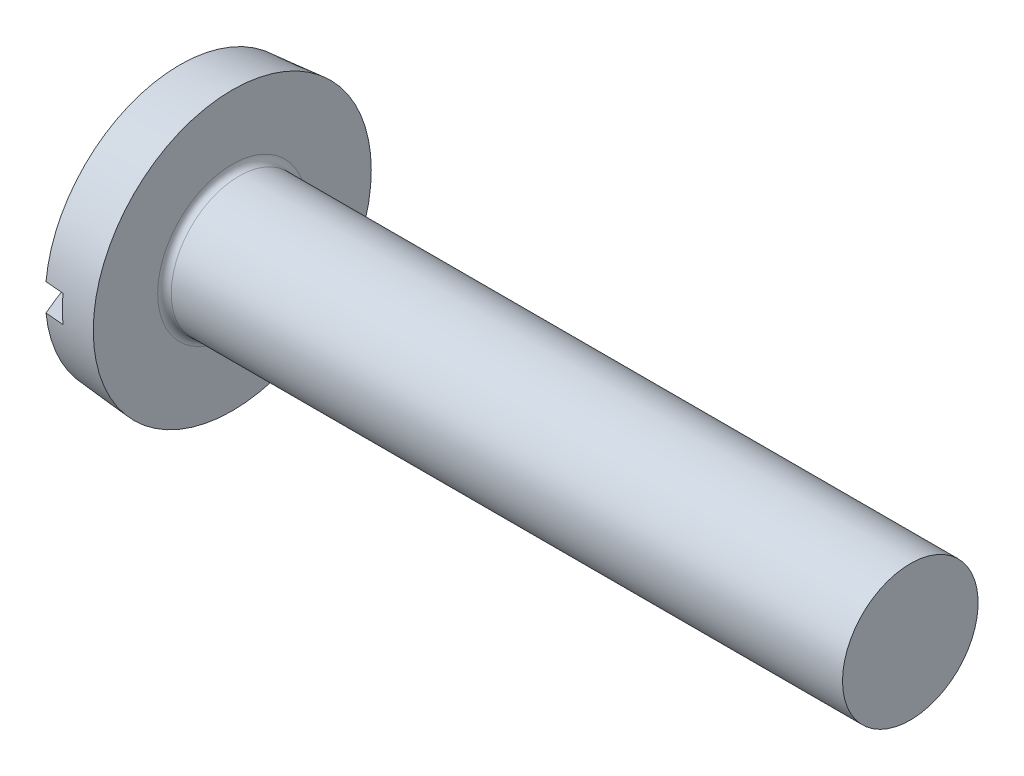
from build123d import *

# Parameters (mm, degrees)
FILLET1_R  = 0.4
SLOTSKE_W  = 16.4
SLOTSKE_H  = 1.6
SLOT_DEPTH = 2.8


with BuildPart() as part:
    # BodySke → BaseBody (revolve)
    with BuildSketch(Plane.XY, mode=Mode.PRIVATE) as basebody_sk:
        with BuildLine():
            Line((4.8, 8.2), (4.8, 4))
            Line((4.8, 4), (44.8, 4))
            Line((44.8, 4), (44.8, 0))
            Line((44.8, 0), (0, 0))
            ThreePointArc((0, 0), (0.42977528, 4.05449238), (1.7, 7.928785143))
            Line((1.7, 7.928785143), (4.8, 8.2))
        make_face()
    revolve(basebody_sk.sketch.rotate(Axis((0, 0, 0), (1, 0, 0)), 90), axis=Axis((0, 0, 0), (1, 0, 0)))

    # Fillet1
    fillet1_edges = [part.edges().sort_by_distance(p)[0] for p in [
        (4.8, 0, -4),
    ]]
    fillet(fillet1_edges, radius=FILLET1_R)

    # SlotSke → Slot (cut)
    with BuildSketch(Plane(origin=(0, 0, 0), x_dir=(0, 0, -1), z_dir=(1, 0, 0))):
        Rectangle(SLOTSKE_W, SLOTSKE_H)
    extrude(amount=SLOT_DEPTH, mode=Mode.SUBTRACT)


solid = part.part
